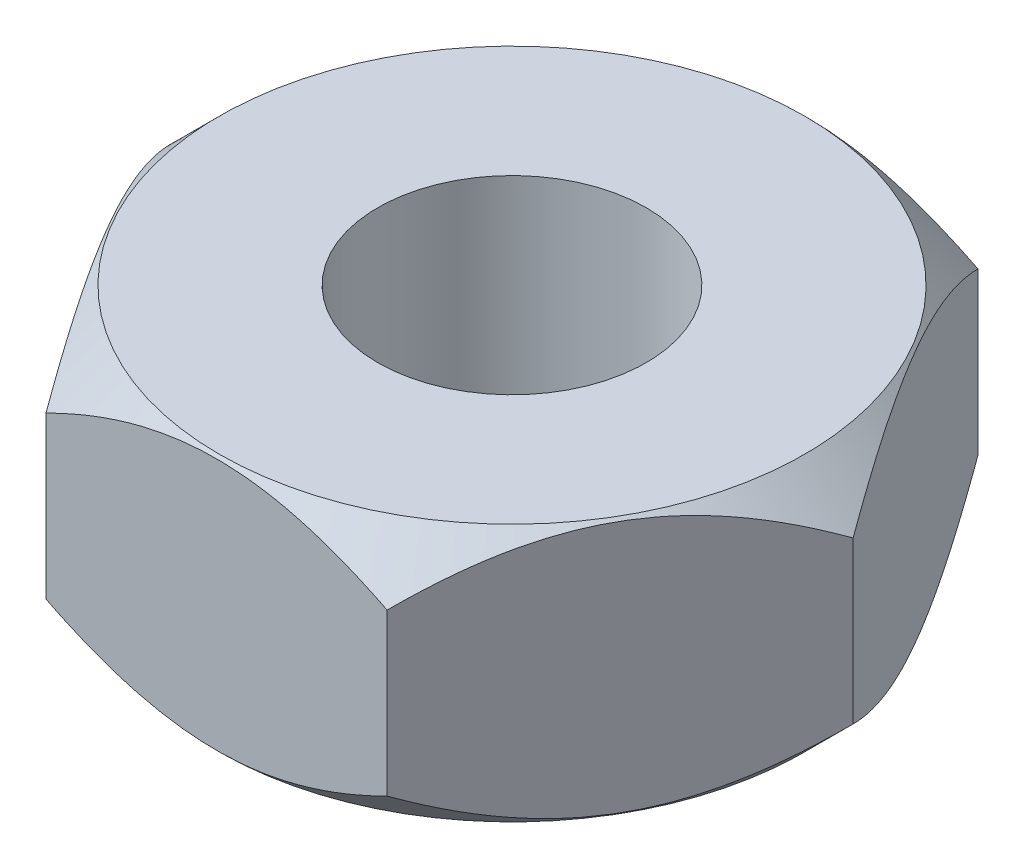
ISO-10303-21;
HEADER;
FILE_DESCRIPTION(('STEP AP214'),'2;1');
FILE_NAME('part.step','',(''),(''),'','','');
FILE_SCHEMA(('AUTOMOTIVE_DESIGN { 1 0 10303 214 1 1 1 1 }'));
ENDSEC;
DATA;
#1=APPLICATION_CONTEXT('core data for automotive mechanical design processes');
#2=APPLICATION_PROTOCOL_DEFINITION('international standard','automotive_design',2000,#1);
#3=PRODUCT_CONTEXT('',#1,'mechanical');
#4=PRODUCT('Part','Part','',(#3));
#5=PRODUCT_RELATED_PRODUCT_CATEGORY('part','',(#4));
#6=PRODUCT_DEFINITION_FORMATION('','',#4);
#7=PRODUCT_DEFINITION_CONTEXT('part definition',#1,'design');
#8=PRODUCT_DEFINITION('design','',#6,#7);
#9=PRODUCT_DEFINITION_SHAPE('','',#8);
#10=(LENGTH_UNIT() NAMED_UNIT(*) SI_UNIT(.MILLI.,.METRE.));
#11=(NAMED_UNIT(*) PLANE_ANGLE_UNIT() SI_UNIT($,.RADIAN.));
#12=(NAMED_UNIT(*) SI_UNIT($,.STERADIAN.) SOLID_ANGLE_UNIT());
#13=UNCERTAINTY_MEASURE_WITH_UNIT(LENGTH_MEASURE(1.E-05),#10,'distance_accuracy_value','');
#14=(GEOMETRIC_REPRESENTATION_CONTEXT(3) GLOBAL_UNCERTAINTY_ASSIGNED_CONTEXT((#13)) GLOBAL_UNIT_ASSIGNED_CONTEXT((#10,
#11,#12)) REPRESENTATION_CONTEXT('',''));
#15=CARTESIAN_POINT('',(0.,0.,0.));
#16=DIRECTION('',(0.,0.,1.));
#17=DIRECTION('',(1.,0.,0.));
#18=AXIS2_PLACEMENT_3D('',#15,#16,#17);
#19=CARTESIAN_POINT('',(3.17542648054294,2.4,0.));
#20=DIRECTION('',(-0.866025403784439,0.,0.5));
#21=DIRECTION('',(0.5,0.,0.866025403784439));
#22=AXIS2_PLACEMENT_3D('',#19,#20,#21);
#23=PLANE('',#22);
#24=CARTESIAN_POINT('',(1.58759777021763,0.45011547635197,-2.7502));
#25=CARTESIAN_POINT('',(1.64217521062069,0.395584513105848,-2.65566910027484));
#26=CARTESIAN_POINT('',(1.69766525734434,0.344256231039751,-2.55955752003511));
#27=CARTESIAN_POINT('',(1.81081556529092,0.250275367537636,-2.36357543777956));
#28=CARTESIAN_POINT('',(1.8684865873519,0.207675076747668,-2.26368629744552));
#29=CARTESIAN_POINT('',(1.9847774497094,0.134699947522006,-2.06226461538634));
#30=CARTESIAN_POINT('',(2.04336767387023,0.104141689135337,-1.96078337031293));
#31=CARTESIAN_POINT('',(2.16183796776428,0.0570603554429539,-1.75558680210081));
#32=CARTESIAN_POINT('',(2.22171441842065,0.0405021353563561,-1.6518777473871));
#33=CARTESIAN_POINT('',(2.32490849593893,0.0255623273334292,-1.47314036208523));
#34=CARTESIAN_POINT('',(2.36809280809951,0.0233507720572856,-1.3983429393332));
#35=CARTESIAN_POINT('',(2.45439083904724,0.0270767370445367,-1.24887036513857));
#36=CARTESIAN_POINT('',(2.49750452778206,0.0330171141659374,-1.17419526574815));
#37=CARTESIAN_POINT('',(2.58332480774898,0.0527088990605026,-1.02555018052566));
#38=CARTESIAN_POINT('',(2.62603088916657,0.0664690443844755,-0.951581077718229));
#39=CARTESIAN_POINT('',(2.71070455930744,0.101045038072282,-0.804921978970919));
#40=CARTESIAN_POINT('',(2.75267220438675,0.12186034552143,-0.732231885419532));
#41=CARTESIAN_POINT('',(2.86016705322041,0.183653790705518,-0.546045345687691));
#42=CARTESIAN_POINT('',(2.92502780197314,0.229289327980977,-0.43370323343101));
#43=CARTESIAN_POINT('',(3.02039991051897,0.306328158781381,-0.26851389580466));
#44=CARTESIAN_POINT('',(3.05182928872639,0.333396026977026,-0.214076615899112));
#45=CARTESIAN_POINT('',(3.11410588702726,0.389999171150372,-0.106210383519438));
#46=CARTESIAN_POINT('',(3.14495345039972,0.419532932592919,-0.0527808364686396));
#47=CARTESIAN_POINT('',(3.17554195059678,0.450115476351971,0.000199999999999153));
#48=B_SPLINE_CURVE_WITH_KNOTS('',3,(#24,#25,#26,#27,#28,#29,#30,#31,#32,#33,#34,#35,#36,#37,#38,
#39,#40,#41,#42,#43,#44,#45,#46,#47),.UNSPECIFIED.,.F.,.F.,(4,2,2,2,2,2,2,2,2,2,2,4),(0.,
0.366307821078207,0.734749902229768,1.09734036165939,1.45901787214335,1.71784182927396,
1.97675651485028,2.23596107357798,2.49514576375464,2.90682558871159,3.11210731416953,
3.31726387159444),.UNSPECIFIED.);
#49=CARTESIAN_POINT('',(1.58771324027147,0.449999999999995,-2.75));
#50=VERTEX_POINT('',#49);
#51=CARTESIAN_POINT('',(3.17542648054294,0.449999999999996,0.));
#52=VERTEX_POINT('',#51);
#53=EDGE_CURVE('E51',#50,#52,#48,.T.);
#54=ORIENTED_EDGE('',*,*,#53,.F.);
#55=DIRECTION('',(0.,-1.,0.));
#56=VECTOR('',#55,1.);
#57=CARTESIAN_POINT('',(1.58771324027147,2.4,-2.75));
#58=LINE('',#57,#56);
#59=CARTESIAN_POINT('',(1.58771324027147,1.95000000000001,-2.75));
#60=VERTEX_POINT('',#59);
#61=EDGE_CURVE('E11',#60,#50,#58,.T.);
#62=ORIENTED_EDGE('',*,*,#61,.F.);
#63=CARTESIAN_POINT('',(3.17554195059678,1.94988452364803,0.000199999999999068));
#64=CARTESIAN_POINT('',(3.12096451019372,2.00441548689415,-0.0943308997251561));
#65=CARTESIAN_POINT('',(3.06547446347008,2.05574376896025,-0.190442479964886));
#66=CARTESIAN_POINT('',(2.95232415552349,2.14972463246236,-0.386424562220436));
#67=CARTESIAN_POINT('',(2.89465313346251,2.19232492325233,-0.486313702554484));
#68=CARTESIAN_POINT('',(2.77836227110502,2.26530005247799,-0.687735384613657));
#69=CARTESIAN_POINT('',(2.71977204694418,2.29585831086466,-0.789216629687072));
#70=CARTESIAN_POINT('',(2.60130175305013,2.34293964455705,-0.994413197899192));
#71=CARTESIAN_POINT('',(2.54142530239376,2.35949786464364,-1.0981222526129));
#72=CARTESIAN_POINT('',(2.43823122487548,2.37443767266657,-1.27685963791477));
#73=CARTESIAN_POINT('',(2.3950469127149,2.37664922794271,-1.35165706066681));
#74=CARTESIAN_POINT('',(2.30874888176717,2.37292326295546,-1.50112963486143));
#75=CARTESIAN_POINT('',(2.26563519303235,2.36698288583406,-1.57580473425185));
#76=CARTESIAN_POINT('',(2.17981491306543,2.3472911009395,-1.72444981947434));
#77=CARTESIAN_POINT('',(2.13710883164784,2.33353095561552,-1.79841892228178));
#78=CARTESIAN_POINT('',(2.05243516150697,2.29895496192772,-1.94507802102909));
#79=CARTESIAN_POINT('',(2.01046751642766,2.27813965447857,-2.01776811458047));
#80=CARTESIAN_POINT('',(1.902972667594,2.21634620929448,-2.20395465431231));
#81=CARTESIAN_POINT('',(1.83811191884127,2.17071067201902,-2.31629676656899));
#82=CARTESIAN_POINT('',(1.74273981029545,2.09367184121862,-2.48148610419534));
#83=CARTESIAN_POINT('',(1.71131043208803,2.06660397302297,-2.53592338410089));
#84=CARTESIAN_POINT('',(1.64903383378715,2.01000082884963,-2.64378961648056));
#85=CARTESIAN_POINT('',(1.61818627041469,1.98046706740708,-2.69721916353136));
#86=CARTESIAN_POINT('',(1.58759777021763,1.94988452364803,-2.7502));
#87=B_SPLINE_CURVE_WITH_KNOTS('',3,(#63,#64,#65,#66,#67,#68,#69,#70,#71,#72,#73,#74,#75,#76,#77,
#78,#79,#80,#81,#82,#83,#84,#85,#86),.UNSPECIFIED.,.F.,.F.,(4,2,2,2,2,2,2,2,2,2,2,4),(0.,
0.366307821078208,0.73474990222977,1.0973403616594,1.45901787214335,1.71784182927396,
1.97675651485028,2.23596107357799,2.49514576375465,2.90682558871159,3.11210731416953,
3.31726387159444),.UNSPECIFIED.);
#88=CARTESIAN_POINT('',(3.17542648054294,1.95000000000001,0.));
#89=VERTEX_POINT('',#88);
#90=EDGE_CURVE('E107',#89,#60,#87,.T.);
#91=ORIENTED_EDGE('',*,*,#90,.F.);
#92=DIRECTION('',(0.,-1.,0.));
#93=VECTOR('',#92,1.);
#94=CARTESIAN_POINT('',(3.17542648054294,2.4,0.));
#95=LINE('',#94,#93);
#96=EDGE_CURVE('E100',#89,#52,#95,.T.);
#97=ORIENTED_EDGE('',*,*,#96,.T.);
#98=EDGE_LOOP('',(#54,#62,#91,#97));
#99=FACE_BOUND('',#98,.T.);
#100=ADVANCED_FACE('F36',(#99),#23,.F.);
#101=CARTESIAN_POINT('',(1.58771324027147,2.4,-2.75));
#102=DIRECTION('',(0.,0.,1.));
#103=DIRECTION('',(1.,0.,0.));
#104=AXIS2_PLACEMENT_3D('',#101,#102,#103);
#105=PLANE('',#104);
#106=CARTESIAN_POINT('',(-3.30351523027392,1.57291190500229,-2.75));
#107=CARTESIAN_POINT('',(-3.22366549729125,1.51155667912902,-2.75));
#108=CARTESIAN_POINT('',(-3.14338439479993,1.45075400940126,-2.75));
#109=CARTESIAN_POINT('',(-2.98178353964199,1.33050589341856,-2.75));
#110=CARTESIAN_POINT('',(-2.90046354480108,1.27106077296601,-2.75));
#111=CARTESIAN_POINT('',(-2.73601462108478,1.15335680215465,-2.75));
#112=CARTESIAN_POINT('',(-2.65287657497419,1.09511064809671,-2.75));
#113=CARTESIAN_POINT('',(-2.48521489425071,0.980654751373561,-2.75));
#114=CARTESIAN_POINT('',(-2.40069135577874,0.924444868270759,-2.75));
#115=CARTESIAN_POINT('',(-2.22463832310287,0.811054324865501,-2.75));
#116=CARTESIAN_POINT('',(-2.13300344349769,0.754036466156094,-2.75));
#117=CARTESIAN_POINT('',(-1.94760970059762,0.643570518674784,-2.75));
#118=CARTESIAN_POINT('',(-1.85385111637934,0.590121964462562,-2.75));
#119=CARTESIAN_POINT('',(-1.66414624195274,0.487907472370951,-2.75));
#120=CARTESIAN_POINT('',(-1.56820706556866,0.439128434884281,-2.75));
#121=CARTESIAN_POINT('',(-1.37362276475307,0.347354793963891,-2.75));
#122=CARTESIAN_POINT('',(-1.27497894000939,0.304357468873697,-2.75));
#123=CARTESIAN_POINT('',(-1.08453682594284,0.229539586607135,-2.75));
#124=CARTESIAN_POINT('',(-0.9930088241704,0.197038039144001,-2.75));
#125=CARTESIAN_POINT('',(-0.807629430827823,0.13936207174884,-2.75));
#126=CARTESIAN_POINT('',(-0.713777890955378,0.114188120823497,-2.75));
#127=CARTESIAN_POINT('',(-0.525941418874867,0.0729461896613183,-2.75));
#128=CARTESIAN_POINT('',(-0.431993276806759,0.0567134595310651,-2.75));
#129=CARTESIAN_POINT('',(-0.242940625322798,0.033691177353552,-2.75));
#130=CARTESIAN_POINT('',(-0.147836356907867,0.0268996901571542,-2.75));
#131=CARTESIAN_POINT('',(0.0384524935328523,0.0233334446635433,-2.75));
#132=CARTESIAN_POINT('',(0.129629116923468,0.0261390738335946,-2.75));
#133=CARTESIAN_POINT('',(0.311265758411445,0.0406513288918,-2.75));
#134=CARTESIAN_POINT('',(0.40172571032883,0.0523587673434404,-2.75));
#135=CARTESIAN_POINT('',(0.582810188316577,0.0842123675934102,-2.75));
#136=CARTESIAN_POINT('',(0.673408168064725,0.104507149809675,-2.75));
#137=CARTESIAN_POINT('',(0.852601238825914,0.152415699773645,-2.75));
#138=CARTESIAN_POINT('',(0.941196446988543,0.180029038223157,-2.75));
#139=CARTESIAN_POINT('',(1.21423680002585,0.275671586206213,-2.75));
#140=CARTESIAN_POINT('',(1.39496632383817,0.35434224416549,-2.75));
#141=CARTESIAN_POINT('',(1.65947293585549,0.485569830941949,-2.75));
#142=CARTESIAN_POINT('',(1.74670611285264,0.531617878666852,-2.75));
#143=CARTESIAN_POINT('',(1.91919758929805,0.627283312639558,-2.75));
#144=CARTESIAN_POINT('',(2.0044562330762,0.676900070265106,-2.75));
#145=CARTESIAN_POINT('',(2.16906056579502,0.776465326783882,-2.75));
#146=CARTESIAN_POINT('',(2.24849032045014,0.826276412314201,-2.75));
#147=CARTESIAN_POINT('',(2.40598696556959,0.928018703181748,-2.75));
#148=CARTESIAN_POINT('',(2.48405375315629,0.979950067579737,-2.75));
#149=CARTESIAN_POINT('',(2.6383728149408,1.08513030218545,-2.75));
#150=CARTESIAN_POINT('',(2.714634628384,1.13836523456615,-2.75));
#151=CARTESIAN_POINT('',(2.86611225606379,1.24626109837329,-2.75));
#152=CARTESIAN_POINT('',(2.94132835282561,1.30092163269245,-2.75));
#153=CARTESIAN_POINT('',(3.0161060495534,1.35616581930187,-2.75));
#154=B_SPLINE_CURVE_WITH_KNOTS('',3,(#106,#107,#108,#109,#110,#111,#112,#113,#114,#115,#116,
#117,#118,#119,#120,#121,#122,#123,#124,#125,#126,#127,#128,#129,#130,#131,#132,#133,#134,#135,
#136,#137,#138,#139,#140,#141,#142,#143,#144,#145,#146,#147,#148,#149,#150,#151,#152,#153),
.UNSPECIFIED.,.F.,.F.,(4,2,2,2,2,2,2,2,2,2,2,2,2,2,2,2,2,2,2,2,2,2,2,4),(0.,0.302104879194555,
0.604281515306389,0.908790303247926,1.21327804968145,1.53699149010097,1.86066263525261,
2.1833973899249,2.50597968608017,2.79711035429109,3.08825965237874,3.37384765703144,
3.65937711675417,3.93258489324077,4.20581761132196,4.48398612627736,4.76213832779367,
5.35164121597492,5.64753916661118,5.94338512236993,6.22461953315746,6.50587508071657,
6.78487088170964,7.06378978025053),.UNSPECIFIED.);
#155=CARTESIAN_POINT('',(-1.58771324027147,0.449999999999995,-2.75));
#156=VERTEX_POINT('',#155);
#157=EDGE_CURVE('E87',#156,#50,#154,.T.);
#158=ORIENTED_EDGE('',*,*,#157,.F.);
#159=DIRECTION('',(0.,-1.,0.));
#160=VECTOR('',#159,1.);
#161=CARTESIAN_POINT('',(-1.58771324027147,2.4,-2.75));
#162=LINE('',#161,#160);
#163=CARTESIAN_POINT('',(-1.58771324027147,1.95000000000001,-2.75));
#164=VERTEX_POINT('',#163);
#165=EDGE_CURVE('E44',#164,#156,#162,.T.);
#166=ORIENTED_EDGE('',*,*,#165,.F.);
#167=CARTESIAN_POINT('',(-3.30351523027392,0.827088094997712,-2.75));
#168=CARTESIAN_POINT('',(-3.22366549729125,0.888443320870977,-2.75));
#169=CARTESIAN_POINT('',(-3.14338439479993,0.949245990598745,-2.75));
#170=CARTESIAN_POINT('',(-2.98178353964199,1.06949410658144,-2.75));
#171=CARTESIAN_POINT('',(-2.90046354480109,1.12893922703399,-2.75));
#172=CARTESIAN_POINT('',(-2.73601462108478,1.24664319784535,-2.75));
#173=CARTESIAN_POINT('',(-2.65287657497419,1.30488935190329,-2.75));
#174=CARTESIAN_POINT('',(-2.48521489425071,1.41934524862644,-2.75));
#175=CARTESIAN_POINT('',(-2.40069135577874,1.47555513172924,-2.75));
#176=CARTESIAN_POINT('',(-2.22463832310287,1.5889456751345,-2.75));
#177=CARTESIAN_POINT('',(-2.13300344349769,1.64596353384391,-2.75));
#178=CARTESIAN_POINT('',(-1.94760970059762,1.75642948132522,-2.75));
#179=CARTESIAN_POINT('',(-1.85385111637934,1.80987803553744,-2.75));
#180=CARTESIAN_POINT('',(-1.66414624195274,1.91209252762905,-2.75));
#181=CARTESIAN_POINT('',(-1.56820706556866,1.96087156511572,-2.75));
#182=CARTESIAN_POINT('',(-1.37362276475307,2.05264520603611,-2.75));
#183=CARTESIAN_POINT('',(-1.27497894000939,2.0956425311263,-2.75));
#184=CARTESIAN_POINT('',(-1.08453682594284,2.17046041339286,-2.75));
#185=CARTESIAN_POINT('',(-0.993008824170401,2.202961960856,-2.75));
#186=CARTESIAN_POINT('',(-0.807629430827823,2.26063792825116,-2.75));
#187=CARTESIAN_POINT('',(-0.713777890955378,2.2858118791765,-2.75));
#188=CARTESIAN_POINT('',(-0.525941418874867,2.32705381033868,-2.75));
#189=CARTESIAN_POINT('',(-0.431993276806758,2.34328654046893,-2.75));
#190=CARTESIAN_POINT('',(-0.242940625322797,2.36630882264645,-2.75));
#191=CARTESIAN_POINT('',(-0.147836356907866,2.37310030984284,-2.75));
#192=CARTESIAN_POINT('',(0.0384524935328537,2.37666655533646,-2.75));
#193=CARTESIAN_POINT('',(0.12962911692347,2.3738609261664,-2.75));
#194=CARTESIAN_POINT('',(0.311265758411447,2.3593486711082,-2.75));
#195=CARTESIAN_POINT('',(0.401725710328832,2.34764123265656,-2.75));
#196=CARTESIAN_POINT('',(0.58281018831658,2.31578763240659,-2.75));
#197=CARTESIAN_POINT('',(0.673408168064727,2.29549285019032,-2.75));
#198=CARTESIAN_POINT('',(0.852601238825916,2.24758430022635,-2.75));
#199=CARTESIAN_POINT('',(0.941196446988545,2.21997096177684,-2.75));
#200=CARTESIAN_POINT('',(1.21423680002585,2.12432841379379,-2.75));
#201=CARTESIAN_POINT('',(1.39496632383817,2.04565775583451,-2.75));
#202=CARTESIAN_POINT('',(1.65947293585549,1.91443016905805,-2.75));
#203=CARTESIAN_POINT('',(1.74670611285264,1.86838212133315,-2.75));
#204=CARTESIAN_POINT('',(1.91919758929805,1.77271668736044,-2.75));
#205=CARTESIAN_POINT('',(2.00445623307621,1.72309992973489,-2.75));
#206=CARTESIAN_POINT('',(2.16906056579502,1.62353467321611,-2.75));
#207=CARTESIAN_POINT('',(2.24849032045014,1.5737235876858,-2.75));
#208=CARTESIAN_POINT('',(2.4059869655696,1.47198129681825,-2.75));
#209=CARTESIAN_POINT('',(2.48405375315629,1.42004993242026,-2.75));
#210=CARTESIAN_POINT('',(2.63837281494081,1.31486969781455,-2.75));
#211=CARTESIAN_POINT('',(2.71463462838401,1.26163476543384,-2.75));
#212=CARTESIAN_POINT('',(2.8661122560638,1.1537389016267,-2.75));
#213=CARTESIAN_POINT('',(2.94132835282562,1.09907836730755,-2.75));
#214=CARTESIAN_POINT('',(3.01610604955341,1.04383418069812,-2.75));
#215=B_SPLINE_CURVE_WITH_KNOTS('',3,(#167,#168,#169,#170,#171,#172,#173,#174,#175,#176,#177,
#178,#179,#180,#181,#182,#183,#184,#185,#186,#187,#188,#189,#190,#191,#192,#193,#194,#195,#196,
#197,#198,#199,#200,#201,#202,#203,#204,#205,#206,#207,#208,#209,#210,#211,#212,#213,#214),
.UNSPECIFIED.,.F.,.F.,(4,2,2,2,2,2,2,2,2,2,2,2,2,2,2,2,2,2,2,2,2,2,2,4),(0.,0.302104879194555,
0.604281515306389,0.908790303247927,1.21327804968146,1.53699149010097,1.86066263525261,
2.1833973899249,2.50597968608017,2.79711035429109,3.08825965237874,3.37384765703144,
3.65937711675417,3.93258489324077,4.20581761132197,4.48398612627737,4.76213832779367,
5.35164121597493,5.64753916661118,5.94338512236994,6.22461953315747,6.50587508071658,
6.78487088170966,7.06378978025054),.UNSPECIFIED.);
#216=EDGE_CURVE('E105',#60,#164,#215,.F.);
#217=ORIENTED_EDGE('',*,*,#216,.F.);
#218=ORIENTED_EDGE('',*,*,#61,.T.);
#219=EDGE_LOOP('',(#158,#166,#217,#218));
#220=FACE_BOUND('',#219,.T.);
#221=ADVANCED_FACE('F104',(#220),#105,.F.);
#222=CARTESIAN_POINT('',(-1.58771324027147,2.4,-2.75));
#223=DIRECTION('',(0.866025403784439,0.,0.5));
#224=DIRECTION('',(0.5,0.,-0.866025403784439));
#225=AXIS2_PLACEMENT_3D('',#222,#223,#224);
#226=PLANE('',#225);
#227=CARTESIAN_POINT('',(-3.17554195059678,0.45011547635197,0.000199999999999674));
#228=CARTESIAN_POINT('',(-3.12096451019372,0.395584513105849,-0.0943308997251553));
#229=CARTESIAN_POINT('',(-3.06547446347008,0.344256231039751,-0.190442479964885));
#230=CARTESIAN_POINT('',(-2.95232415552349,0.250275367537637,-0.386424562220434));
#231=CARTESIAN_POINT('',(-2.89465313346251,0.207675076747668,-0.486313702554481));
#232=CARTESIAN_POINT('',(-2.77836227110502,0.134699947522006,-0.687735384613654));
#233=CARTESIAN_POINT('',(-2.71977204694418,0.104141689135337,-0.789216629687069));
#234=CARTESIAN_POINT('',(-2.60130175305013,0.0570603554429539,-0.994413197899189));
#235=CARTESIAN_POINT('',(-2.54142530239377,0.0405021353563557,-1.0981222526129));
#236=CARTESIAN_POINT('',(-2.43823122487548,0.0255623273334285,-1.27685963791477));
#237=CARTESIAN_POINT('',(-2.3950469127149,0.0233507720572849,-1.3516570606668));
#238=CARTESIAN_POINT('',(-2.30874888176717,0.0270767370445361,-1.50112963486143));
#239=CARTESIAN_POINT('',(-2.26563519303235,0.0330171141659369,-1.57580473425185));
#240=CARTESIAN_POINT('',(-2.17981491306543,0.0527088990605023,-1.72444981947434));
#241=CARTESIAN_POINT('',(-2.13710883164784,0.0664690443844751,-1.79841892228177));
#242=CARTESIAN_POINT('',(-2.05243516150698,0.101045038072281,-1.94507802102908));
#243=CARTESIAN_POINT('',(-2.01046751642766,0.121860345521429,-2.01776811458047));
#244=CARTESIAN_POINT('',(-1.902972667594,0.183653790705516,-2.20395465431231));
#245=CARTESIAN_POINT('',(-1.83811191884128,0.229289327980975,-2.31629676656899));
#246=CARTESIAN_POINT('',(-1.74273981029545,0.30632815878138,-2.48148610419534));
#247=CARTESIAN_POINT('',(-1.71131043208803,0.333396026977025,-2.53592338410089));
#248=CARTESIAN_POINT('',(-1.64903383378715,0.389999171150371,-2.64378961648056));
#249=CARTESIAN_POINT('',(-1.61818627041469,0.419532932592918,-2.69721916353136));
#250=CARTESIAN_POINT('',(-1.58759777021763,0.45011547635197,-2.7502));
#251=B_SPLINE_CURVE_WITH_KNOTS('',3,(#227,#228,#229,#230,#231,#232,#233,#234,#235,#236,#237,
#238,#239,#240,#241,#242,#243,#244,#245,#246,#247,#248,#249,#250),.UNSPECIFIED.,.F.,.F.,(4,2,2,
2,2,2,2,2,2,2,2,4),(0.,0.366307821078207,0.734749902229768,1.09734036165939,1.45901787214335,
1.71784182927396,1.97675651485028,2.23596107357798,2.49514576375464,2.90682558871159,
3.11210731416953,3.31726387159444),.UNSPECIFIED.);
#252=CARTESIAN_POINT('',(-3.17542648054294,0.449999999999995,0.));
#253=VERTEX_POINT('',#252);
#254=EDGE_CURVE('E90',#253,#156,#251,.T.);
#255=ORIENTED_EDGE('',*,*,#254,.F.);
#256=DIRECTION('',(0.,-1.,0.));
#257=VECTOR('',#256,1.);
#258=CARTESIAN_POINT('',(-3.17542648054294,2.4,0.));
#259=LINE('',#258,#257);
#260=CARTESIAN_POINT('',(-3.17542648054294,1.95000000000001,0.));
#261=VERTEX_POINT('',#260);
#262=EDGE_CURVE('E307',#261,#253,#259,.T.);
#263=ORIENTED_EDGE('',*,*,#262,.F.);
#264=CARTESIAN_POINT('',(-1.58759777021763,1.94988452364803,-2.7502));
#265=CARTESIAN_POINT('',(-1.64217521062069,2.00441548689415,-2.65566910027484));
#266=CARTESIAN_POINT('',(-1.69766525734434,2.05574376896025,-2.55955752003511));
#267=CARTESIAN_POINT('',(-1.81081556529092,2.14972463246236,-2.36357543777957));
#268=CARTESIAN_POINT('',(-1.8684865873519,2.19232492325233,-2.26368629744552));
#269=CARTESIAN_POINT('',(-1.98477744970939,2.26530005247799,-2.06226461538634));
#270=CARTESIAN_POINT('',(-2.04336767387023,2.29585831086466,-1.96078337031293));
#271=CARTESIAN_POINT('',(-2.16183796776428,2.34293964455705,-1.75558680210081));
#272=CARTESIAN_POINT('',(-2.22171441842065,2.35949786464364,-1.6518777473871));
#273=CARTESIAN_POINT('',(-2.32490849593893,2.37443767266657,-1.47314036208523));
#274=CARTESIAN_POINT('',(-2.36809280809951,2.37664922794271,-1.39834293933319));
#275=CARTESIAN_POINT('',(-2.45439083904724,2.37292326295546,-1.24887036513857));
#276=CARTESIAN_POINT('',(-2.49750452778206,2.36698288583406,-1.17419526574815));
#277=CARTESIAN_POINT('',(-2.58332480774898,2.3472911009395,-1.02555018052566));
#278=CARTESIAN_POINT('',(-2.62603088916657,2.33353095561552,-0.951581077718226));
#279=CARTESIAN_POINT('',(-2.71070455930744,2.29895496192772,-0.804921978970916));
#280=CARTESIAN_POINT('',(-2.75267220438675,2.27813965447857,-0.732231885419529));
#281=CARTESIAN_POINT('',(-2.86016705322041,2.21634620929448,-0.546045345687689));
#282=CARTESIAN_POINT('',(-2.92502780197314,2.17071067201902,-0.433703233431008));
#283=CARTESIAN_POINT('',(-3.02039991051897,2.09367184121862,-0.268513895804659));
#284=CARTESIAN_POINT('',(-3.05182928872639,2.06660397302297,-0.214076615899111));
#285=CARTESIAN_POINT('',(-3.11410588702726,2.01000082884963,-0.106210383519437));
#286=CARTESIAN_POINT('',(-3.14495345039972,1.98046706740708,-0.052780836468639));
#287=CARTESIAN_POINT('',(-3.17554195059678,1.94988452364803,0.000199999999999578));
#288=B_SPLINE_CURVE_WITH_KNOTS('',3,(#264,#265,#266,#267,#268,#269,#270,#271,#272,#273,#274,
#275,#276,#277,#278,#279,#280,#281,#282,#283,#284,#285,#286,#287),.UNSPECIFIED.,.F.,.F.,(4,2,2,
2,2,2,2,2,2,2,2,4),(0.,0.366307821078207,0.734749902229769,1.0973403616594,1.45901787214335,
1.71784182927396,1.97675651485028,2.23596107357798,2.49514576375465,2.90682558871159,
3.11210731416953,3.31726387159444),.UNSPECIFIED.);
#289=EDGE_CURVE('E108',#164,#261,#288,.T.);
#290=ORIENTED_EDGE('',*,*,#289,.F.);
#291=ORIENTED_EDGE('',*,*,#165,.T.);
#292=EDGE_LOOP('',(#255,#263,#290,#291));
#293=FACE_BOUND('',#292,.T.);
#294=ADVANCED_FACE('F136',(#293),#226,.F.);
#295=CARTESIAN_POINT('',(-3.17542648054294,2.4,0.));
#296=DIRECTION('',(0.866025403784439,0.,-0.5));
#297=DIRECTION('',(-0.5,0.,-0.866025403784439));
#298=AXIS2_PLACEMENT_3D('',#295,#296,#297);
#299=PLANE('',#298);
#300=CARTESIAN_POINT('',(-1.58759777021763,0.45011547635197,2.7502));
#301=CARTESIAN_POINT('',(-1.64217521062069,0.395584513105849,2.65566910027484));
#302=CARTESIAN_POINT('',(-1.69766525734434,0.344256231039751,2.55955752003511));
#303=CARTESIAN_POINT('',(-1.81081556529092,0.250275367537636,2.36357543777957));
#304=CARTESIAN_POINT('',(-1.8684865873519,0.207675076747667,2.26368629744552));
#305=CARTESIAN_POINT('',(-1.98477744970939,0.134699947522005,2.06226461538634));
#306=CARTESIAN_POINT('',(-2.04336767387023,0.104141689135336,1.96078337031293));
#307=CARTESIAN_POINT('',(-2.16183796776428,0.0570603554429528,1.75558680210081));
#308=CARTESIAN_POINT('',(-2.22171441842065,0.0405021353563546,1.6518777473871));
#309=CARTESIAN_POINT('',(-2.32490849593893,0.0255623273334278,1.47314036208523));
#310=CARTESIAN_POINT('',(-2.36809280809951,0.0233507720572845,1.39834293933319));
#311=CARTESIAN_POINT('',(-2.45439083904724,0.0270767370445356,1.24887036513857));
#312=CARTESIAN_POINT('',(-2.49750452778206,0.033017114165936,1.17419526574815));
#313=CARTESIAN_POINT('',(-2.58332480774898,0.0527088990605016,1.02555018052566));
#314=CARTESIAN_POINT('',(-2.62603088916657,0.066469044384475,0.951581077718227));
#315=CARTESIAN_POINT('',(-2.71070455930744,0.101045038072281,0.804921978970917));
#316=CARTESIAN_POINT('',(-2.75267220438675,0.121860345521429,0.732231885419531));
#317=CARTESIAN_POINT('',(-2.86016705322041,0.183653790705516,0.54604534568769));
#318=CARTESIAN_POINT('',(-2.92502780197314,0.229289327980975,0.433703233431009));
#319=CARTESIAN_POINT('',(-3.02039991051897,0.306328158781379,0.268513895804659));
#320=CARTESIAN_POINT('',(-3.05182928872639,0.333396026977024,0.21407661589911));
#321=CARTESIAN_POINT('',(-3.11410588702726,0.389999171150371,0.106210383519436));
#322=CARTESIAN_POINT('',(-3.14495345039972,0.419532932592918,0.0527808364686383));
#323=CARTESIAN_POINT('',(-3.17554195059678,0.45011547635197,-0.000200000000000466));
#324=B_SPLINE_CURVE_WITH_KNOTS('',3,(#300,#301,#302,#303,#304,#305,#306,#307,#308,#309,#310,
#311,#312,#313,#314,#315,#316,#317,#318,#319,#320,#321,#322,#323),.UNSPECIFIED.,.F.,.F.,(4,2,2,
2,2,2,2,2,2,2,2,4),(0.,0.366307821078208,0.73474990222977,1.0973403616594,1.45901787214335,
1.71784182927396,1.97675651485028,2.23596107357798,2.49514576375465,2.90682558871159,
3.11210731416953,3.31726387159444),.UNSPECIFIED.);
#325=CARTESIAN_POINT('',(-1.58771324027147,0.449999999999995,2.75));
#326=VERTEX_POINT('',#325);
#327=EDGE_CURVE('E178',#326,#253,#324,.T.);
#328=ORIENTED_EDGE('',*,*,#327,.F.);
#329=DIRECTION('',(0.,-1.,0.));
#330=VECTOR('',#329,1.);
#331=CARTESIAN_POINT('',(-1.58771324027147,2.4,2.75));
#332=LINE('',#331,#330);
#333=CARTESIAN_POINT('',(-1.58771324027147,1.95000000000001,2.75));
#334=VERTEX_POINT('',#333);
#335=EDGE_CURVE('E304',#334,#326,#332,.T.);
#336=ORIENTED_EDGE('',*,*,#335,.F.);
#337=CARTESIAN_POINT('',(-3.17554195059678,1.94988452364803,-0.000200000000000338));
#338=CARTESIAN_POINT('',(-3.12096451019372,2.00441548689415,0.0943308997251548));
#339=CARTESIAN_POINT('',(-3.06547446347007,2.05574376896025,0.190442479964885));
#340=CARTESIAN_POINT('',(-2.95232415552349,2.14972463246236,0.386424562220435));
#341=CARTESIAN_POINT('',(-2.89465313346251,2.19232492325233,0.486313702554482));
#342=CARTESIAN_POINT('',(-2.77836227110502,2.26530005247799,0.687735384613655));
#343=CARTESIAN_POINT('',(-2.71977204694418,2.29585831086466,0.789216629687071));
#344=CARTESIAN_POINT('',(-2.60130175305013,2.34293964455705,0.994413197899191));
#345=CARTESIAN_POINT('',(-2.54142530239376,2.35949786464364,1.0981222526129));
#346=CARTESIAN_POINT('',(-2.43823122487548,2.37443767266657,1.27685963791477));
#347=CARTESIAN_POINT('',(-2.3950469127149,2.37664922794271,1.35165706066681));
#348=CARTESIAN_POINT('',(-2.30874888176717,2.37292326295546,1.50112963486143));
#349=CARTESIAN_POINT('',(-2.26563519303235,2.36698288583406,1.57580473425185));
#350=CARTESIAN_POINT('',(-2.17981491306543,2.3472911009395,1.72444981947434));
#351=CARTESIAN_POINT('',(-2.13710883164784,2.33353095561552,1.79841892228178));
#352=CARTESIAN_POINT('',(-2.05243516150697,2.29895496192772,1.94507802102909));
#353=CARTESIAN_POINT('',(-2.01046751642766,2.27813965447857,2.01776811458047));
#354=CARTESIAN_POINT('',(-1.902972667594,2.21634620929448,2.20395465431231));
#355=CARTESIAN_POINT('',(-1.83811191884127,2.17071067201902,2.31629676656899));
#356=CARTESIAN_POINT('',(-1.74273981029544,2.09367184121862,2.48148610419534));
#357=CARTESIAN_POINT('',(-1.71131043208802,2.06660397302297,2.53592338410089));
#358=CARTESIAN_POINT('',(-1.64903383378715,2.01000082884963,2.64378961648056));
#359=CARTESIAN_POINT('',(-1.61818627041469,1.98046706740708,2.69721916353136));
#360=CARTESIAN_POINT('',(-1.58759777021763,1.94988452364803,2.7502));
#361=B_SPLINE_CURVE_WITH_KNOTS('',3,(#337,#338,#339,#340,#341,#342,#343,#344,#345,#346,#347,
#348,#349,#350,#351,#352,#353,#354,#355,#356,#357,#358,#359,#360),.UNSPECIFIED.,.F.,.F.,(4,2,2,
2,2,2,2,2,2,2,2,4),(0.,0.366307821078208,0.734749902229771,1.0973403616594,1.45901787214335,
1.71784182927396,1.97675651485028,2.23596107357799,2.49514576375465,2.90682558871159,
3.11210731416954,3.31726387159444),.UNSPECIFIED.);
#362=EDGE_CURVE('E112',#261,#334,#361,.T.);
#363=ORIENTED_EDGE('',*,*,#362,.F.);
#364=ORIENTED_EDGE('',*,*,#262,.T.);
#365=EDGE_LOOP('',(#328,#336,#363,#364));
#366=FACE_BOUND('',#365,.T.);
#367=ADVANCED_FACE('F183',(#366),#299,.F.);
#368=CARTESIAN_POINT('',(-1.58771324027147,2.4,2.75));
#369=DIRECTION('',(0.,0.,-1.));
#370=DIRECTION('',(-1.,0.,0.));
#371=AXIS2_PLACEMENT_3D('',#368,#369,#370);
#372=PLANE('',#371);
#373=CARTESIAN_POINT('',(-3.30351523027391,1.57291190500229,2.75));
#374=CARTESIAN_POINT('',(-3.22366549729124,1.51155667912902,2.75));
#375=CARTESIAN_POINT('',(-3.14338439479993,1.45075400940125,2.75));
#376=CARTESIAN_POINT('',(-2.98178353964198,1.33050589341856,2.75));
#377=CARTESIAN_POINT('',(-2.90046354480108,1.27106077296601,2.75));
#378=CARTESIAN_POINT('',(-2.73601462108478,1.15335680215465,2.75));
#379=CARTESIAN_POINT('',(-2.65287657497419,1.09511064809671,2.75));
#380=CARTESIAN_POINT('',(-2.48521489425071,0.98065475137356,2.75));
#381=CARTESIAN_POINT('',(-2.40069135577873,0.924444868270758,2.75));
#382=CARTESIAN_POINT('',(-2.22463832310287,0.8110543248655,2.75));
#383=CARTESIAN_POINT('',(-2.13300344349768,0.754036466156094,2.75));
#384=CARTESIAN_POINT('',(-1.94760970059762,0.643570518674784,2.75));
#385=CARTESIAN_POINT('',(-1.85385111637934,0.590121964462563,2.75));
#386=CARTESIAN_POINT('',(-1.66414624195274,0.487907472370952,2.75));
#387=CARTESIAN_POINT('',(-1.56820706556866,0.439128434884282,2.75));
#388=CARTESIAN_POINT('',(-1.37362276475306,0.347354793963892,2.75));
#389=CARTESIAN_POINT('',(-1.27497894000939,0.304357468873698,2.75));
#390=CARTESIAN_POINT('',(-1.08453682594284,0.229539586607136,2.75));
#391=CARTESIAN_POINT('',(-0.9930088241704,0.197038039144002,2.75));
#392=CARTESIAN_POINT('',(-0.807629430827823,0.139362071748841,2.75));
#393=CARTESIAN_POINT('',(-0.713777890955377,0.114188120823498,2.75));
#394=CARTESIAN_POINT('',(-0.525941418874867,0.0729461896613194,2.75));
#395=CARTESIAN_POINT('',(-0.431993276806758,0.0567134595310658,2.75));
#396=CARTESIAN_POINT('',(-0.242940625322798,0.0336911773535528,2.75));
#397=CARTESIAN_POINT('',(-0.147836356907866,0.0268996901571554,2.75));
#398=CARTESIAN_POINT('',(0.0384524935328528,0.0233334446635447,2.75));
#399=CARTESIAN_POINT('',(0.129629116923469,0.0261390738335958,2.75));
#400=CARTESIAN_POINT('',(0.311265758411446,0.0406513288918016,2.75));
#401=CARTESIAN_POINT('',(0.401725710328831,0.0523587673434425,2.75));
#402=CARTESIAN_POINT('',(0.582810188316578,0.0842123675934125,2.75));
#403=CARTESIAN_POINT('',(0.673408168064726,0.104507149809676,2.75));
#404=CARTESIAN_POINT('',(0.852601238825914,0.152415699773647,2.75));
#405=CARTESIAN_POINT('',(0.941196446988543,0.180029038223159,2.75));
#406=CARTESIAN_POINT('',(1.21423680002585,0.275671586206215,2.75));
#407=CARTESIAN_POINT('',(1.39496632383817,0.354342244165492,2.75));
#408=CARTESIAN_POINT('',(1.65947293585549,0.485569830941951,2.75));
#409=CARTESIAN_POINT('',(1.74670611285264,0.531617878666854,2.75));
#410=CARTESIAN_POINT('',(1.91919758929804,0.627283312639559,2.75));
#411=CARTESIAN_POINT('',(2.0044562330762,0.676900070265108,2.75));
#412=CARTESIAN_POINT('',(2.16906056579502,0.776465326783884,2.75));
#413=CARTESIAN_POINT('',(2.24849032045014,0.826276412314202,2.75));
#414=CARTESIAN_POINT('',(2.40598696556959,0.92801870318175,2.75));
#415=CARTESIAN_POINT('',(2.48405375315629,0.979950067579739,2.75));
#416=CARTESIAN_POINT('',(2.6383728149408,1.08513030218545,2.75));
#417=CARTESIAN_POINT('',(2.714634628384,1.13836523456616,2.75));
#418=CARTESIAN_POINT('',(2.86611225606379,1.2462610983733,2.75));
#419=CARTESIAN_POINT('',(2.94132835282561,1.30092163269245,2.75));
#420=CARTESIAN_POINT('',(3.0161060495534,1.35616581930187,2.75));
#421=B_SPLINE_CURVE_WITH_KNOTS('',3,(#373,#374,#375,#376,#377,#378,#379,#380,#381,#382,#383,
#384,#385,#386,#387,#388,#389,#390,#391,#392,#393,#394,#395,#396,#397,#398,#399,#400,#401,#402,
#403,#404,#405,#406,#407,#408,#409,#410,#411,#412,#413,#414,#415,#416,#417,#418,#419,#420),
.UNSPECIFIED.,.F.,.F.,(4,2,2,2,2,2,2,2,2,2,2,2,2,2,2,2,2,2,2,2,2,2,2,4),(0.,0.302104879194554,
0.604281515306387,0.908790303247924,1.21327804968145,1.53699149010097,1.8606626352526,
2.1833973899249,2.50597968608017,2.79711035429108,3.08825965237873,3.37384765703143,
3.65937711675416,3.93258489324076,4.20581761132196,4.48398612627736,4.76213832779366,
5.35164121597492,5.64753916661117,5.94338512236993,6.22461953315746,6.50587508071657,
6.78487088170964,7.06378978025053),.UNSPECIFIED.);
#422=CARTESIAN_POINT('',(1.58771324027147,0.449999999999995,2.75));
#423=VERTEX_POINT('',#422);
#424=EDGE_CURVE('E171',#423,#326,#421,.F.);
#425=ORIENTED_EDGE('',*,*,#424,.F.);
#426=DIRECTION('',(0.,-1.,0.));
#427=VECTOR('',#426,1.);
#428=CARTESIAN_POINT('',(1.58771324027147,2.4,2.75));
#429=LINE('',#428,#427);
#430=CARTESIAN_POINT('',(1.58771324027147,1.95,2.75));
#431=VERTEX_POINT('',#430);
#432=EDGE_CURVE('E302',#431,#423,#429,.T.);
#433=ORIENTED_EDGE('',*,*,#432,.F.);
#434=CARTESIAN_POINT('',(-3.30351523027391,0.827088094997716,2.75));
#435=CARTESIAN_POINT('',(-3.22366549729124,0.88844332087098,2.75));
#436=CARTESIAN_POINT('',(-3.14338439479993,0.949245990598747,2.75));
#437=CARTESIAN_POINT('',(-2.98178353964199,1.06949410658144,2.75));
#438=CARTESIAN_POINT('',(-2.90046354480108,1.12893922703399,2.75));
#439=CARTESIAN_POINT('',(-2.73601462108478,1.24664319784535,2.75));
#440=CARTESIAN_POINT('',(-2.65287657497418,1.30488935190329,2.75));
#441=CARTESIAN_POINT('',(-2.48521489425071,1.41934524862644,2.75));
#442=CARTESIAN_POINT('',(-2.40069135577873,1.47555513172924,2.75));
#443=CARTESIAN_POINT('',(-2.22463832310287,1.5889456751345,2.75));
#444=CARTESIAN_POINT('',(-2.13300344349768,1.64596353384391,2.75));
#445=CARTESIAN_POINT('',(-1.94760970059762,1.75642948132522,2.75));
#446=CARTESIAN_POINT('',(-1.85385111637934,1.80987803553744,2.75));
#447=CARTESIAN_POINT('',(-1.66414624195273,1.91209252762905,2.75));
#448=CARTESIAN_POINT('',(-1.56820706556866,1.96087156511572,2.75));
#449=CARTESIAN_POINT('',(-1.37362276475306,2.05264520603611,2.75));
#450=CARTESIAN_POINT('',(-1.27497894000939,2.0956425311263,2.75));
#451=CARTESIAN_POINT('',(-1.08453682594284,2.17046041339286,2.75));
#452=CARTESIAN_POINT('',(-0.993008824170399,2.202961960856,2.75));
#453=CARTESIAN_POINT('',(-0.807629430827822,2.26063792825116,2.75));
#454=CARTESIAN_POINT('',(-0.713777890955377,2.2858118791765,2.75));
#455=CARTESIAN_POINT('',(-0.525941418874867,2.32705381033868,2.75));
#456=CARTESIAN_POINT('',(-0.431993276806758,2.34328654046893,2.75));
#457=CARTESIAN_POINT('',(-0.242940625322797,2.36630882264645,2.75));
#458=CARTESIAN_POINT('',(-0.147836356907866,2.37310030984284,2.75));
#459=CARTESIAN_POINT('',(0.0384524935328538,2.37666655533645,2.75));
#460=CARTESIAN_POINT('',(0.12962911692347,2.3738609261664,2.75));
#461=CARTESIAN_POINT('',(0.311265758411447,2.3593486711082,2.75));
#462=CARTESIAN_POINT('',(0.401725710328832,2.34764123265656,2.75));
#463=CARTESIAN_POINT('',(0.58281018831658,2.31578763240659,2.75));
#464=CARTESIAN_POINT('',(0.673408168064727,2.29549285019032,2.75));
#465=CARTESIAN_POINT('',(0.852601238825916,2.24758430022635,2.75));
#466=CARTESIAN_POINT('',(0.941196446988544,2.21997096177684,2.75));
#467=CARTESIAN_POINT('',(1.21423680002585,2.12432841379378,2.75));
#468=CARTESIAN_POINT('',(1.39496632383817,2.04565775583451,2.75));
#469=CARTESIAN_POINT('',(1.65947293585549,1.91443016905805,2.75));
#470=CARTESIAN_POINT('',(1.74670611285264,1.86838212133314,2.75));
#471=CARTESIAN_POINT('',(1.91919758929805,1.77271668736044,2.75));
#472=CARTESIAN_POINT('',(2.00445623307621,1.72309992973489,2.75));
#473=CARTESIAN_POINT('',(2.16906056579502,1.62353467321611,2.75));
#474=CARTESIAN_POINT('',(2.24849032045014,1.57372358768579,2.75));
#475=CARTESIAN_POINT('',(2.4059869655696,1.47198129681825,2.75));
#476=CARTESIAN_POINT('',(2.48405375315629,1.42004993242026,2.75));
#477=CARTESIAN_POINT('',(2.63837281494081,1.31486969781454,2.75));
#478=CARTESIAN_POINT('',(2.714634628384,1.26163476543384,2.75));
#479=CARTESIAN_POINT('',(2.8661122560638,1.1537389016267,2.75));
#480=CARTESIAN_POINT('',(2.94132835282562,1.09907836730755,2.75));
#481=CARTESIAN_POINT('',(3.01610604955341,1.04383418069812,2.75));
#482=B_SPLINE_CURVE_WITH_KNOTS('',3,(#434,#435,#436,#437,#438,#439,#440,#441,#442,#443,#444,
#445,#446,#447,#448,#449,#450,#451,#452,#453,#454,#455,#456,#457,#458,#459,#460,#461,#462,#463,
#464,#465,#466,#467,#468,#469,#470,#471,#472,#473,#474,#475,#476,#477,#478,#479,#480,#481),
.UNSPECIFIED.,.F.,.F.,(4,2,2,2,2,2,2,2,2,2,2,2,2,2,2,2,2,2,2,2,2,2,2,4),(0.,0.302104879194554,
0.604281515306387,0.908790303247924,1.21327804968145,1.53699149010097,1.8606626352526,
2.1833973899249,2.50597968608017,2.79711035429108,3.08825965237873,3.37384765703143,
3.65937711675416,3.93258489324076,4.20581761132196,4.48398612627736,4.76213832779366,
5.35164121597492,5.64753916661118,5.94338512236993,6.22461953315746,6.50587508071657,
6.78487088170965,7.06378978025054),.UNSPECIFIED.);
#483=EDGE_CURVE('E59',#334,#431,#482,.T.);
#484=ORIENTED_EDGE('',*,*,#483,.F.);
#485=ORIENTED_EDGE('',*,*,#335,.T.);
#486=EDGE_LOOP('',(#425,#433,#484,#485));
#487=FACE_BOUND('',#486,.T.);
#488=ADVANCED_FACE('F186',(#487),#372,.F.);
#489=CARTESIAN_POINT('',(1.58771324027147,2.4,2.75));
#490=DIRECTION('',(-0.866025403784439,0.,-0.5));
#491=DIRECTION('',(-0.5,0.,0.866025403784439));
#492=AXIS2_PLACEMENT_3D('',#489,#490,#491);
#493=PLANE('',#492);
#494=CARTESIAN_POINT('',(3.17554195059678,0.450115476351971,-0.000200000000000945));
#495=CARTESIAN_POINT('',(3.12096451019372,0.395584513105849,0.0943308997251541));
#496=CARTESIAN_POINT('',(3.06547446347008,0.344256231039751,0.190442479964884));
#497=CARTESIAN_POINT('',(2.95232415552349,0.250275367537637,0.386424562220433));
#498=CARTESIAN_POINT('',(2.89465313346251,0.207675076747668,0.486313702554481));
#499=CARTESIAN_POINT('',(2.77836227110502,0.134699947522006,0.687735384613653));
#500=CARTESIAN_POINT('',(2.71977204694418,0.104141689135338,0.789216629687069));
#501=CARTESIAN_POINT('',(2.60130175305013,0.0570603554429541,0.994413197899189));
#502=CARTESIAN_POINT('',(2.54142530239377,0.0405021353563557,1.0981222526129));
#503=CARTESIAN_POINT('',(2.43823122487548,0.0255623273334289,1.27685963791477));
#504=CARTESIAN_POINT('',(2.3950469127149,0.0233507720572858,1.3516570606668));
#505=CARTESIAN_POINT('',(2.30874888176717,0.027076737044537,1.50112963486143));
#506=CARTESIAN_POINT('',(2.26563519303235,0.0330171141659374,1.57580473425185));
#507=CARTESIAN_POINT('',(2.17981491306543,0.0527088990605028,1.72444981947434));
#508=CARTESIAN_POINT('',(2.13710883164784,0.066469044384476,1.79841892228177));
#509=CARTESIAN_POINT('',(2.05243516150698,0.101045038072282,1.94507802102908));
#510=CARTESIAN_POINT('',(2.01046751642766,0.12186034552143,2.01776811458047));
#511=CARTESIAN_POINT('',(1.902972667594,0.183653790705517,2.20395465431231));
#512=CARTESIAN_POINT('',(1.83811191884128,0.229289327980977,2.31629676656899));
#513=CARTESIAN_POINT('',(1.74273981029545,0.306328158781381,2.48148610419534));
#514=CARTESIAN_POINT('',(1.71131043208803,0.333396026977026,2.53592338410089));
#515=CARTESIAN_POINT('',(1.64903383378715,0.389999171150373,2.64378961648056));
#516=CARTESIAN_POINT('',(1.61818627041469,0.41953293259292,2.69721916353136));
#517=CARTESIAN_POINT('',(1.58759777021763,0.450115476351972,2.7502));
#518=B_SPLINE_CURVE_WITH_KNOTS('',3,(#494,#495,#496,#497,#498,#499,#500,#501,#502,#503,#504,
#505,#506,#507,#508,#509,#510,#511,#512,#513,#514,#515,#516,#517),.UNSPECIFIED.,.F.,.F.,(4,2,2,
2,2,2,2,2,2,2,2,4),(0.,0.366307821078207,0.734749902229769,1.0973403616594,1.45901787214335,
1.71784182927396,1.97675651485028,2.23596107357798,2.49514576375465,2.90682558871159,
3.11210731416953,3.31726387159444),.UNSPECIFIED.);
#519=EDGE_CURVE('E161',#52,#423,#518,.T.);
#520=ORIENTED_EDGE('',*,*,#519,.F.);
#521=ORIENTED_EDGE('',*,*,#96,.F.);
#522=CARTESIAN_POINT('',(1.58759777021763,1.94988452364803,2.7502));
#523=CARTESIAN_POINT('',(1.64217521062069,2.00441548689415,2.65566910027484));
#524=CARTESIAN_POINT('',(1.69766525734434,2.05574376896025,2.55955752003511));
#525=CARTESIAN_POINT('',(1.81081556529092,2.14972463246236,2.36357543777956));
#526=CARTESIAN_POINT('',(1.86848658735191,2.19232492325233,2.26368629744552));
#527=CARTESIAN_POINT('',(1.9847774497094,2.26530005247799,2.06226461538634));
#528=CARTESIAN_POINT('',(2.04336767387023,2.29585831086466,1.96078337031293));
#529=CARTESIAN_POINT('',(2.16183796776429,2.34293964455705,1.75558680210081));
#530=CARTESIAN_POINT('',(2.22171441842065,2.35949786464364,1.6518777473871));
#531=CARTESIAN_POINT('',(2.32490849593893,2.37443767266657,1.47314036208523));
#532=CARTESIAN_POINT('',(2.36809280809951,2.37664922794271,1.39834293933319));
#533=CARTESIAN_POINT('',(2.45439083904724,2.37292326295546,1.24887036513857));
#534=CARTESIAN_POINT('',(2.49750452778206,2.36698288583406,1.17419526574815));
#535=CARTESIAN_POINT('',(2.58332480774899,2.3472911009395,1.02555018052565));
#536=CARTESIAN_POINT('',(2.62603088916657,2.33353095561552,0.951581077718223));
#537=CARTESIAN_POINT('',(2.71070455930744,2.29895496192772,0.804921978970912));
#538=CARTESIAN_POINT('',(2.75267220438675,2.27813965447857,0.732231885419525));
#539=CARTESIAN_POINT('',(2.86016705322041,2.21634620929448,0.546045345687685));
#540=CARTESIAN_POINT('',(2.92502780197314,2.17071067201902,0.433703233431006));
#541=CARTESIAN_POINT('',(3.02039991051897,2.09367184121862,0.268513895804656));
#542=CARTESIAN_POINT('',(3.05182928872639,2.06660397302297,0.214076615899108));
#543=CARTESIAN_POINT('',(3.11410588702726,2.01000082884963,0.106210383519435));
#544=CARTESIAN_POINT('',(3.14495345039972,1.98046706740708,0.0527808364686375));
#545=CARTESIAN_POINT('',(3.17554195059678,1.94988452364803,-0.000200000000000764));
#546=B_SPLINE_CURVE_WITH_KNOTS('',3,(#522,#523,#524,#525,#526,#527,#528,#529,#530,#531,#532,
#533,#534,#535,#536,#537,#538,#539,#540,#541,#542,#543,#544,#545),.UNSPECIFIED.,.F.,.F.,(4,2,2,
2,2,2,2,2,2,2,2,4),(0.,0.366307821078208,0.734749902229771,1.0973403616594,1.45901787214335,
1.71784182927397,1.97675651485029,2.23596107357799,2.49514576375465,2.90682558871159,
3.11210731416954,3.31726387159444),.UNSPECIFIED.);
#547=EDGE_CURVE('E200',#431,#89,#546,.T.);
#548=ORIENTED_EDGE('',*,*,#547,.F.);
#549=ORIENTED_EDGE('',*,*,#432,.T.);
#550=EDGE_LOOP('',(#520,#521,#548,#549));
#551=FACE_BOUND('',#550,.T.);
#552=ADVANCED_FACE('F205',(#551),#493,.F.);
#553=CARTESIAN_POINT('',(0.,0.,0.));
#554=DIRECTION('',(0.,1.,0.));
#555=DIRECTION('',(0.,0.,1.));
#556=AXIS2_PLACEMENT_3D('',#553,#554,#555);
#557=PLANE('',#556);
#558=CARTESIAN_POINT('',(0.,0.,0.));
#559=DIRECTION('',(0.,1.,0.));
#560=DIRECTION('',(0.,0.,1.));
#561=AXIS2_PLACEMENT_3D('',#558,#559,#560);
#562=CIRCLE('',#561,1.25);
#563=CARTESIAN_POINT('',(0.,0.,1.25));
#564=VERTEX_POINT('',#563);
#565=EDGE_CURVE('E309',#564,#564,#562,.T.);
#566=ORIENTED_EDGE('',*,*,#565,.T.);
#567=EDGE_LOOP('',(#566));
#568=FACE_BOUND('',#567,.T.);
#569=CARTESIAN_POINT('',(0.,0.,0.));
#570=DIRECTION('',(0.,-1.,0.));
#571=DIRECTION('',(0.,0.,-1.));
#572=AXIS2_PLACEMENT_3D('',#569,#570,#571);
#573=CIRCLE('',#572,2.72542648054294);
#574=CARTESIAN_POINT('',(0.,0.,-2.72542648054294));
#575=VERTEX_POINT('',#574);
#576=EDGE_CURVE('E325',#575,#575,#573,.T.);
#577=ORIENTED_EDGE('',*,*,#576,.T.);
#578=EDGE_LOOP('',(#577));
#579=FACE_BOUND('',#578,.T.);
#580=ADVANCED_FACE('F209',(#568,#579),#557,.F.);
#581=CARTESIAN_POINT('',(0.,2.4,0.));
#582=DIRECTION('',(0.,1.,0.));
#583=DIRECTION('',(0.,0.,1.));
#584=AXIS2_PLACEMENT_3D('',#581,#582,#583);
#585=PLANE('',#584);
#586=CARTESIAN_POINT('',(0.,2.4,0.));
#587=DIRECTION('',(0.,1.,0.));
#588=DIRECTION('',(0.,0.,1.));
#589=AXIS2_PLACEMENT_3D('',#586,#587,#588);
#590=CIRCLE('',#589,1.25);
#591=CARTESIAN_POINT('',(0.,2.4,1.25));
#592=VERTEX_POINT('',#591);
#593=EDGE_CURVE('E110',#592,#592,#590,.T.);
#594=ORIENTED_EDGE('',*,*,#593,.F.);
#595=EDGE_LOOP('',(#594));
#596=FACE_BOUND('',#595,.T.);
#597=CARTESIAN_POINT('',(0.,2.4,0.));
#598=DIRECTION('',(0.,-1.,0.));
#599=DIRECTION('',(0.,0.,-1.));
#600=AXIS2_PLACEMENT_3D('',#597,#598,#599);
#601=CIRCLE('',#600,2.72542648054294);
#602=CARTESIAN_POINT('',(0.,2.4,-2.72542648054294));
#603=VERTEX_POINT('',#602);
#604=EDGE_CURVE('E101',#603,#603,#601,.T.);
#605=ORIENTED_EDGE('',*,*,#604,.F.);
#606=EDGE_LOOP('',(#605));
#607=FACE_BOUND('',#606,.T.);
#608=ADVANCED_FACE('F214',(#596,#607),#585,.T.);
#609=CARTESIAN_POINT('',(0.,2.4,0.));
#610=DIRECTION('',(0.,1.,0.));
#611=DIRECTION('',(0.,0.,1.));
#612=AXIS2_PLACEMENT_3D('',#609,#610,#611);
#613=CYLINDRICAL_SURFACE('',#612,1.25);
#614=ORIENTED_EDGE('',*,*,#565,.F.);
#615=EDGE_LOOP('',(#614));
#616=FACE_BOUND('',#615,.T.);
#617=ORIENTED_EDGE('',*,*,#593,.T.);
#618=EDGE_LOOP('',(#617));
#619=FACE_BOUND('',#618,.T.);
#620=ADVANCED_FACE('F217',(#616,#619),#613,.F.);
#621=CARTESIAN_POINT('',(0.,1.95000000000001,0.));
#622=DIRECTION('',(0.,-1.,0.));
#623=DIRECTION('',(0.,0.,-1.));
#624=AXIS2_PLACEMENT_3D('',#621,#622,#623);
#625=CONICAL_SURFACE('',#624,3.17542648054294,0.785398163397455);
#626=ORIENTED_EDGE('',*,*,#604,.T.);
#627=EDGE_LOOP('',(#626));
#628=FACE_BOUND('',#627,.T.);
#629=ORIENTED_EDGE('',*,*,#90,.T.);
#630=ORIENTED_EDGE('',*,*,#216,.T.);
#631=ORIENTED_EDGE('',*,*,#289,.T.);
#632=ORIENTED_EDGE('',*,*,#362,.T.);
#633=ORIENTED_EDGE('',*,*,#483,.T.);
#634=ORIENTED_EDGE('',*,*,#547,.T.);
#635=EDGE_LOOP('',(#629,#630,#631,#632,#633,#634));
#636=FACE_BOUND('',#635,.T.);
#637=ADVANCED_FACE('F130',(#628,#636),#625,.T.);
#638=CARTESIAN_POINT('',(0.,0.,0.));
#639=DIRECTION('',(0.,1.,0.));
#640=DIRECTION('',(0.,0.,1.));
#641=AXIS2_PLACEMENT_3D('',#638,#639,#640);
#642=CONICAL_SURFACE('',#641,2.72542648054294,0.785398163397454);
#643=ORIENTED_EDGE('',*,*,#576,.F.);
#644=EDGE_LOOP('',(#643));
#645=FACE_BOUND('',#644,.T.);
#646=ORIENTED_EDGE('',*,*,#53,.T.);
#647=ORIENTED_EDGE('',*,*,#519,.T.);
#648=ORIENTED_EDGE('',*,*,#424,.T.);
#649=ORIENTED_EDGE('',*,*,#327,.T.);
#650=ORIENTED_EDGE('',*,*,#254,.T.);
#651=ORIENTED_EDGE('',*,*,#157,.T.);
#652=EDGE_LOOP('',(#646,#647,#648,#649,#650,#651));
#653=FACE_BOUND('',#652,.T.);
#654=ADVANCED_FACE('F88',(#645,#653),#642,.T.);
#655=CLOSED_SHELL('',(#100,#221,#294,#367,#488,#552,#580,#608,#620,#637,#654));
#656=MANIFOLD_SOLID_BREP('B2',#655);
#657=ADVANCED_BREP_SHAPE_REPRESENTATION('',(#18,#656),#14);
#658=SHAPE_DEFINITION_REPRESENTATION(#9,#657);
ENDSEC;
END-ISO-10303-21;
